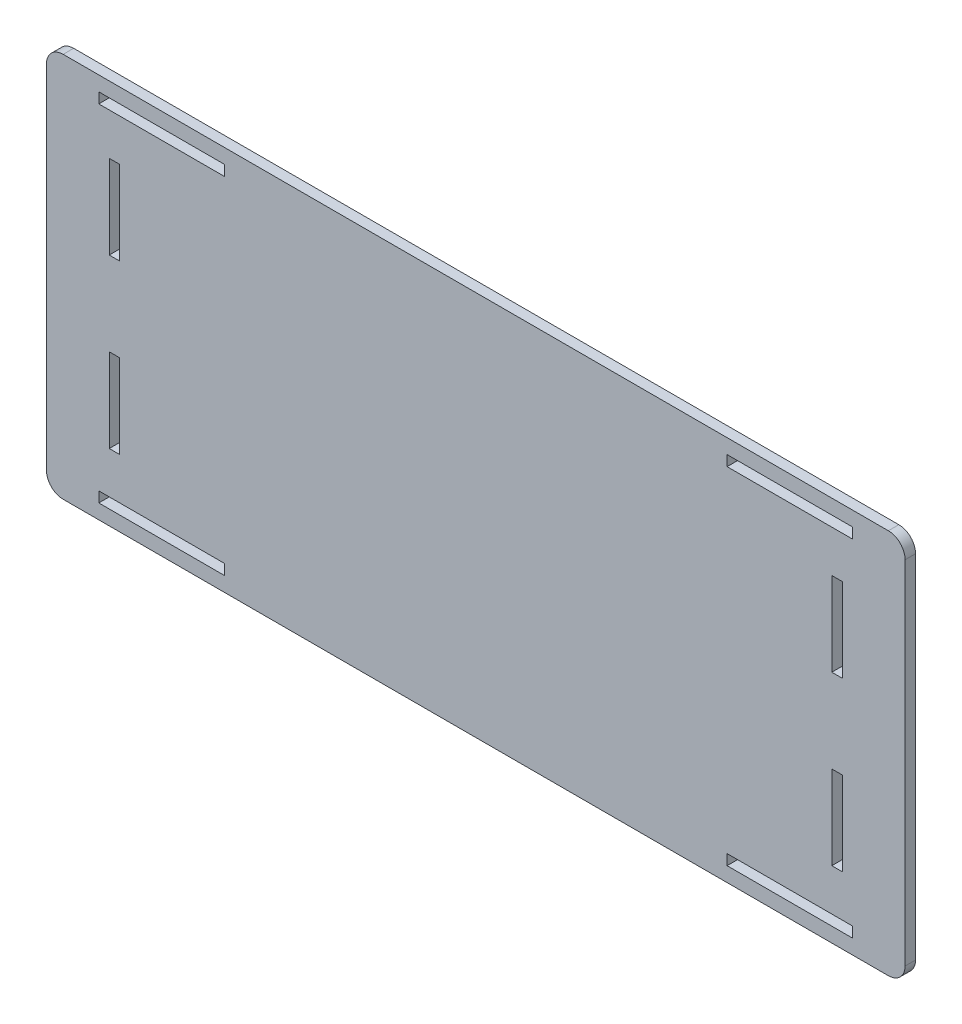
from build123d import *

# Parameters (mm, degrees)
SKETCH1_W           = 260.35
SKETCH1_H           = 116.84
SKETCH1_W_2         = 38.1
SKETCH1_H_2         = 3.175
SKETCH1_W_3         = 3.175
SKETCH1_H_3         = 25.4
BOSS_EXTRUDE1_DEPTH = 3.175
FILLET1_R           = 5.08


with BuildPart() as part:
    # Sketch1 → Boss-Extrude1 (new body)
    with BuildSketch(Plane.XY):
        Rectangle(SKETCH1_W, SKETCH1_H)
        with Locations((95.25, -52.3875)):
            Rectangle(SKETCH1_W_2, SKETCH1_H_2, mode=Mode.SUBTRACT)
        with Locations((109.5375, -25.4)):
            Rectangle(SKETCH1_W_3, SKETCH1_H_3, mode=Mode.SUBTRACT)
        with Locations((109.5375, 25.4)):
            Rectangle(SKETCH1_W_3, SKETCH1_H_3, mode=Mode.SUBTRACT)
        with Locations((95.25, 52.3875)):
            Rectangle(SKETCH1_W_2, SKETCH1_H_2, mode=Mode.SUBTRACT)
        with Locations((-95.25, 52.3875)):
            Rectangle(SKETCH1_W_2, SKETCH1_H_2, mode=Mode.SUBTRACT)
        with Locations((-109.5375, 25.4)):
            Rectangle(SKETCH1_W_3, SKETCH1_H_3, mode=Mode.SUBTRACT)
        with Locations((-109.5375, -25.4)):
            Rectangle(SKETCH1_W_3, SKETCH1_H_3, mode=Mode.SUBTRACT)
        with Locations((-95.25, -52.3875)):
            Rectangle(SKETCH1_W_2, SKETCH1_H_2, mode=Mode.SUBTRACT)
    extrude(amount=BOSS_EXTRUDE1_DEPTH)

    # Fillet1
    fillet1_edges = [part.edges().sort_by_distance(p)[0] for p in [
        (130.175, -58.42, 1.5875),
        (-130.175, -58.42, 1.5875),
        (-130.175, 58.42, 1.5875),
        (130.175, 58.42, 1.5875),
    ]]
    fillet(fillet1_edges, radius=FILLET1_R)


solid = part.part
